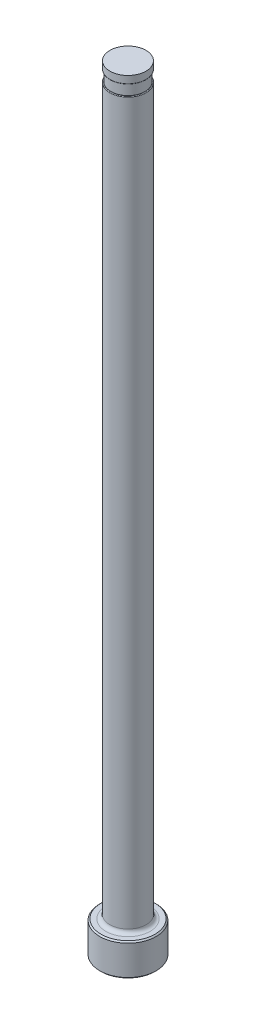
ISO-10303-21;
HEADER;
FILE_DESCRIPTION(('STEP AP214'),'2;1');
FILE_NAME('part.step','',(''),(''),'','','');
FILE_SCHEMA(('AUTOMOTIVE_DESIGN { 1 0 10303 214 1 1 1 1 }'));
ENDSEC;
DATA;
#1=APPLICATION_CONTEXT('core data for automotive mechanical design processes');
#2=APPLICATION_PROTOCOL_DEFINITION('international standard','automotive_design',2000,#1);
#3=PRODUCT_CONTEXT('',#1,'mechanical');
#4=PRODUCT('Part','Part','',(#3));
#5=PRODUCT_RELATED_PRODUCT_CATEGORY('part','',(#4));
#6=PRODUCT_DEFINITION_FORMATION('','',#4);
#7=PRODUCT_DEFINITION_CONTEXT('part definition',#1,'design');
#8=PRODUCT_DEFINITION('design','',#6,#7);
#9=PRODUCT_DEFINITION_SHAPE('','',#8);
#10=(LENGTH_UNIT() NAMED_UNIT(*) SI_UNIT(.MILLI.,.METRE.));
#11=(NAMED_UNIT(*) PLANE_ANGLE_UNIT() SI_UNIT($,.RADIAN.));
#12=(NAMED_UNIT(*) SI_UNIT($,.STERADIAN.) SOLID_ANGLE_UNIT());
#13=UNCERTAINTY_MEASURE_WITH_UNIT(LENGTH_MEASURE(1.E-05),#10,'distance_accuracy_value','');
#14=(GEOMETRIC_REPRESENTATION_CONTEXT(3) GLOBAL_UNCERTAINTY_ASSIGNED_CONTEXT((#13)) GLOBAL_UNIT_ASSIGNED_CONTEXT((#10,
#11,#12)) REPRESENTATION_CONTEXT('',''));
#15=CARTESIAN_POINT('',(0.,0.,0.));
#16=DIRECTION('',(0.,0.,1.));
#17=DIRECTION('',(1.,0.,0.));
#18=AXIS2_PLACEMENT_3D('',#15,#16,#17);
#19=CARTESIAN_POINT('',(-3.57123999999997,150.876,0.));
#20=DIRECTION('',(0.,1.,0.));
#21=DIRECTION('',(0.,0.,1.));
#22=AXIS2_PLACEMENT_3D('',#19,#20,#21);
#23=PLANE('',#22);
#24=CARTESIAN_POINT('',(0.,150.876,0.));
#25=DIRECTION('',(0.,1.,0.));
#26=DIRECTION('',(0.,0.,1.));
#27=AXIS2_PLACEMENT_3D('',#24,#25,#26);
#28=CIRCLE('',#27,3.41883999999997);
#29=CARTESIAN_POINT('',(0.,150.876,3.41883999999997));
#30=VERTEX_POINT('',#29);
#31=EDGE_CURVE('E11',#30,#30,#28,.F.);
#32=ORIENTED_EDGE('',*,*,#31,.T.);
#33=EDGE_LOOP('',(#32));
#34=FACE_BOUND('',#33,.T.);
#35=CARTESIAN_POINT('',(0.,150.876,0.));
#36=DIRECTION('',(0.,1.,0.));
#37=DIRECTION('',(0.,0.,1.));
#38=AXIS2_PLACEMENT_3D('',#35,#36,#37);
#39=CIRCLE('',#38,3.36803999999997);
#40=CARTESIAN_POINT('',(0.,150.876,3.36803999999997));
#41=VERTEX_POINT('',#40);
#42=EDGE_CURVE('E78',#41,#41,#39,.T.);
#43=ORIENTED_EDGE('',*,*,#42,.T.);
#44=EDGE_LOOP('',(#43));
#45=FACE_BOUND('',#44,.T.);
#46=ADVANCED_FACE('F36',(#34,#45),#23,.F.);
#47=CARTESIAN_POINT('',(0.,259.958771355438,0.));
#48=DIRECTION('',(0.,1.,0.));
#49=DIRECTION('',(0.,0.,1.));
#50=AXIS2_PLACEMENT_3D('',#47,#48,#49);
#51=CYLINDRICAL_SURFACE('',#50,3.57123999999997);
#52=DIRECTION('',(0.,1.,0.));
#53=VECTOR('',#52,1.);
#54=CARTESIAN_POINT('',(-3.36803999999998,259.958771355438,-1.18746018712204));
#55=LINE('',#54,#53);
#56=CARTESIAN_POINT('',(-3.36803999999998,148.717,-1.18746018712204));
#57=VERTEX_POINT('',#56);
#58=CARTESIAN_POINT('',(-3.36803999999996,86.36,-1.1874601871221));
#59=VERTEX_POINT('',#58);
#60=EDGE_CURVE('E73',#57,#59,#55,.F.);
#61=ORIENTED_EDGE('',*,*,#60,.F.);
#62=CARTESIAN_POINT('',(0.,148.717,0.));
#63=DIRECTION('',(0.,-1.,0.));
#64=DIRECTION('',(0.,0.,-1.));
#65=AXIS2_PLACEMENT_3D('',#62,#63,#64);
#66=CIRCLE('',#65,3.57123999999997);
#67=CARTESIAN_POINT('',(-3.36803999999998,148.717,1.18746018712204));
#68=VERTEX_POINT('',#67);
#69=EDGE_CURVE('E51',#57,#68,#66,.T.);
#70=ORIENTED_EDGE('',*,*,#69,.T.);
#71=DIRECTION('',(0.,1.,0.));
#72=VECTOR('',#71,1.);
#73=CARTESIAN_POINT('',(-3.36803999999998,259.958771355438,1.18746018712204));
#74=LINE('',#73,#72);
#75=CARTESIAN_POINT('',(-3.36803999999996,86.36,1.18746018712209));
#76=VERTEX_POINT('',#75);
#77=EDGE_CURVE('E84',#76,#68,#74,.T.);
#78=ORIENTED_EDGE('',*,*,#77,.F.);
#79=CARTESIAN_POINT('',(-3.36803999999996,86.36,-1.1874601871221));
#80=CARTESIAN_POINT('',(-3.3680377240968,86.3296283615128,-1.18745959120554));
#81=CARTESIAN_POINT('',(-3.36847634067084,86.29927189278,-1.18622334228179));
#82=CARTESIAN_POINT('',(-3.37021067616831,86.2387876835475,-1.18128966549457));
#83=CARTESIAN_POINT('',(-3.37150629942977,86.2086599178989,-1.1775925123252));
#84=CARTESIAN_POINT('',(-3.37663245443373,86.1190705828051,-1.16285138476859));
#85=CARTESIAN_POINT('',(-3.38170254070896,86.0602347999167,-1.14815759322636));
#86=CARTESIAN_POINT('',(-3.39461112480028,85.9460784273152,-1.10940606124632));
#87=CARTESIAN_POINT('',(-3.40245035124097,85.8907587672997,-1.08534585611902));
#88=CARTESIAN_POINT('',(-3.42005737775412,85.7851328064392,-1.02851526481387));
#89=CARTESIAN_POINT('',(-3.42982508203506,85.7348262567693,-0.995745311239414));
#90=CARTESIAN_POINT('',(-3.45028756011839,85.6403803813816,-0.922345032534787));
#91=CARTESIAN_POINT('',(-3.4609842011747,85.5962539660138,-0.881698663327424));
#92=CARTESIAN_POINT('',(-3.482209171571,85.5151926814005,-0.793737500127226));
#93=CARTESIAN_POINT('',(-3.49273745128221,85.4782598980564,-0.746420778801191));
#94=CARTESIAN_POINT('',(-3.51307583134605,85.4106585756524,-0.644120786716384));
#95=CARTESIAN_POINT('',(-3.52283072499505,85.3803557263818,-0.588885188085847));
#96=CARTESIAN_POINT('',(-3.54010786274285,85.3286078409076,-0.474091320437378));
#97=CARTESIAN_POINT('',(-3.54762954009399,85.3071650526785,-0.414531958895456));
#98=CARTESIAN_POINT('',(-3.56012114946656,85.2722555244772,-0.288969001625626));
#99=CARTESIAN_POINT('',(-3.56491124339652,85.2593434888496,-0.222793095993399));
#100=CARTESIAN_POINT('',(-3.57075657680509,85.243655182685,-0.0890807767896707));
#101=CARTESIAN_POINT('',(-3.57181063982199,85.240882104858,-0.0215439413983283));
#102=CARTESIAN_POINT('',(-3.57004535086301,85.2455778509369,0.115996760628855));
#103=CARTESIAN_POINT('',(-3.56706025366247,85.253484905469,0.185984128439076));
#104=CARTESIAN_POINT('',(-3.55722219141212,85.2803152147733,0.323545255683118));
#105=CARTESIAN_POINT('',(-3.55036911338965,85.2992387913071,0.391118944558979));
#106=CARTESIAN_POINT('',(-3.53356592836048,85.3478994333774,0.521506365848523));
#107=CARTESIAN_POINT('',(-3.52363012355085,85.3775866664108,0.584340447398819));
#108=CARTESIAN_POINT('',(-3.50178692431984,85.447455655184,0.703501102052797));
#109=CARTESIAN_POINT('',(-3.4898802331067,85.4876336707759,0.759829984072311));
#110=CARTESIAN_POINT('',(-3.46618365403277,85.5754388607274,0.861343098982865));
#111=CARTESIAN_POINT('',(-3.45441819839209,85.6225877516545,0.906946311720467));
#112=CARTESIAN_POINT('',(-3.4318469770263,85.7245334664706,0.98893672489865));
#113=CARTESIAN_POINT('',(-3.42104103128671,85.7793288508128,1.02532565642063));
#114=CARTESIAN_POINT('',(-3.40231953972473,85.8914535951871,1.08578170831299));
#115=CARTESIAN_POINT('',(-3.3942694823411,85.9484337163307,1.1104570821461));
#116=CARTESIAN_POINT('',(-3.38112795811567,86.0660270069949,1.14985485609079));
#117=CARTESIAN_POINT('',(-3.37603276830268,86.1266354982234,1.16458978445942));
#118=CARTESIAN_POINT('',(-3.37115526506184,86.2165050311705,1.17859463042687));
#119=CARTESIAN_POINT('',(-3.36998926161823,86.245115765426,1.18192009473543));
#120=CARTESIAN_POINT('',(-3.36843159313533,86.302479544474,1.18635035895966));
#121=CARTESIAN_POINT('',(-3.36803858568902,86.3312322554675,1.18745900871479));
#122=CARTESIAN_POINT('',(-3.36803999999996,86.36,1.1874601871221));
#123=B_SPLINE_CURVE_WITH_KNOTS('',3,(#79,#80,#81,#82,#83,#84,#85,#86,#87,#88,#89,#90,#91,#92,
#93,#94,#95,#96,#97,#98,#99,#100,#101,#102,#103,#104,#105,#106,#107,#108,#109,#110,#111,#112,
#113,#114,#115,#116,#117,#118,#119,#120,#121,#122),.UNSPECIFIED.,.F.,.F.,(4,2,2,2,2,2,2,2,2,2,2,
2,2,2,2,2,2,2,2,2,2,4),(0.,0.0910565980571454,0.182103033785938,0.363698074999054,
0.545340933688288,0.726974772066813,0.908982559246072,1.09104304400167,1.28146671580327,
1.47193867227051,1.67381993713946,1.87576476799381,2.08625256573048,2.29674651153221,
2.50627812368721,2.71573513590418,2.9146211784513,3.1134698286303,3.30038893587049,
3.48707202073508,3.57347157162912,3.65972094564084),.UNSPECIFIED.);
#124=EDGE_CURVE('E81',#59,#76,#123,.T.);
#125=ORIENTED_EDGE('',*,*,#124,.F.);
#126=EDGE_LOOP('',(#61,#70,#78,#125));
#127=FACE_BOUND('',#126,.T.);
#128=CARTESIAN_POINT('',(0.,7.11200000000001,0.));
#129=DIRECTION('',(0.,1.,0.));
#130=DIRECTION('',(0.,0.,1.));
#131=AXIS2_PLACEMENT_3D('',#128,#129,#130);
#132=CIRCLE('',#131,3.57123999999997);
#133=CARTESIAN_POINT('',(0.,7.11200000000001,3.57123999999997));
#134=VERTEX_POINT('',#133);
#135=EDGE_CURVE('E116',#134,#134,#132,.T.);
#136=ORIENTED_EDGE('',*,*,#135,.T.);
#137=EDGE_LOOP('',(#136));
#138=FACE_BOUND('',#137,.T.);
#139=ADVANCED_FACE('F82',(#127,#138),#51,.T.);
#140=CARTESIAN_POINT('',(0.,0.,0.));
#141=DIRECTION('',(0.,-1.,0.));
#142=DIRECTION('',(0.,0.,-1.));
#143=AXIS2_PLACEMENT_3D('',#140,#141,#142);
#144=PLANE('',#143);
#145=CARTESIAN_POINT('',(0.,0.,0.));
#146=DIRECTION('',(0.,-1.,0.));
#147=DIRECTION('',(0.,0.,-1.));
#148=AXIS2_PLACEMENT_3D('',#145,#146,#147);
#149=CIRCLE('',#148,5.29589999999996);
#150=CARTESIAN_POINT('',(0.,0.,-5.29589999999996));
#151=VERTEX_POINT('',#150);
#152=EDGE_CURVE('E113',#151,#151,#149,.T.);
#153=ORIENTED_EDGE('',*,*,#152,.T.);
#154=EDGE_LOOP('',(#153));
#155=FACE_BOUND('',#154,.T.);
#156=ADVANCED_FACE('F192',(#155),#144,.T.);
#157=CARTESIAN_POINT('',(0.,259.958771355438,0.));
#158=DIRECTION('',(0.,1.,0.));
#159=DIRECTION('',(0.,0.,1.));
#160=AXIS2_PLACEMENT_3D('',#157,#158,#159);
#161=CYLINDRICAL_SURFACE('',#160,5.54989999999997);
#162=CARTESIAN_POINT('',(0.,6.09599999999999,0.));
#163=DIRECTION('',(0.,1.,0.));
#164=DIRECTION('',(0.,0.,1.));
#165=AXIS2_PLACEMENT_3D('',#162,#163,#164);
#166=CIRCLE('',#165,5.54989999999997);
#167=CARTESIAN_POINT('',(0.,6.09599999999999,5.54989999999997));
#168=VERTEX_POINT('',#167);
#169=EDGE_CURVE('E110',#168,#168,#166,.F.);
#170=ORIENTED_EDGE('',*,*,#169,.T.);
#171=EDGE_LOOP('',(#170));
#172=FACE_BOUND('',#171,.T.);
#173=CARTESIAN_POINT('',(0.,0.253999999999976,0.));
#174=DIRECTION('',(0.,-1.,0.));
#175=DIRECTION('',(0.,0.,-1.));
#176=AXIS2_PLACEMENT_3D('',#173,#174,#175);
#177=CIRCLE('',#176,5.54989999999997);
#178=CARTESIAN_POINT('',(0.,0.253999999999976,-5.54989999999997));
#179=VERTEX_POINT('',#178);
#180=EDGE_CURVE('E107',#179,#179,#177,.F.);
#181=ORIENTED_EDGE('',*,*,#180,.T.);
#182=EDGE_LOOP('',(#181));
#183=FACE_BOUND('',#182,.T.);
#184=ADVANCED_FACE('F195',(#172,#183),#161,.T.);
#185=CARTESIAN_POINT('',(-5.54989999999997,6.35,0.));
#186=DIRECTION('',(0.,1.,0.));
#187=DIRECTION('',(0.,0.,1.));
#188=AXIS2_PLACEMENT_3D('',#185,#186,#187);
#189=PLANE('',#188);
#190=CARTESIAN_POINT('',(0.,6.35,0.));
#191=DIRECTION('',(0.,1.,0.));
#192=DIRECTION('',(0.,0.,1.));
#193=AXIS2_PLACEMENT_3D('',#190,#191,#192);
#194=CIRCLE('',#193,4.33323999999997);
#195=CARTESIAN_POINT('',(0.,6.35,4.33323999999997));
#196=VERTEX_POINT('',#195);
#197=EDGE_CURVE('E87',#196,#196,#194,.F.);
#198=ORIENTED_EDGE('',*,*,#197,.T.);
#199=EDGE_LOOP('',(#198));
#200=FACE_BOUND('',#199,.T.);
#201=CARTESIAN_POINT('',(0.,6.35,0.));
#202=DIRECTION('',(0.,1.,0.));
#203=DIRECTION('',(0.,0.,1.));
#204=AXIS2_PLACEMENT_3D('',#201,#202,#203);
#205=CIRCLE('',#204,5.29589999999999);
#206=CARTESIAN_POINT('',(0.,6.35,5.29589999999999));
#207=VERTEX_POINT('',#206);
#208=EDGE_CURVE('E104',#207,#207,#205,.T.);
#209=ORIENTED_EDGE('',*,*,#208,.T.);
#210=EDGE_LOOP('',(#209));
#211=FACE_BOUND('',#210,.T.);
#212=ADVANCED_FACE('F190',(#200,#211),#189,.T.);
#213=CARTESIAN_POINT('',(0.,6.35000000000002,0.));
#214=DIRECTION('',(0.,-1.,0.));
#215=DIRECTION('',(0.,0.,-1.));
#216=AXIS2_PLACEMENT_3D('',#213,#214,#215);
#217=CONICAL_SURFACE('',#216,5.29589999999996,0.785398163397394);
#218=ORIENTED_EDGE('',*,*,#169,.F.);
#219=EDGE_LOOP('',(#218));
#220=FACE_BOUND('',#219,.T.);
#221=ORIENTED_EDGE('',*,*,#208,.F.);
#222=EDGE_LOOP('',(#221));
#223=FACE_BOUND('',#222,.T.);
#224=ADVANCED_FACE('F186',(#220,#223),#217,.T.);
#225=CARTESIAN_POINT('',(0.,0.253999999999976,0.));
#226=DIRECTION('',(0.,1.,0.));
#227=DIRECTION('',(0.,0.,1.));
#228=AXIS2_PLACEMENT_3D('',#225,#226,#227);
#229=CONICAL_SURFACE('',#228,5.54989999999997,0.785398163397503);
#230=ORIENTED_EDGE('',*,*,#152,.F.);
#231=EDGE_LOOP('',(#230));
#232=FACE_BOUND('',#231,.T.);
#233=ORIENTED_EDGE('',*,*,#180,.F.);
#234=EDGE_LOOP('',(#233));
#235=FACE_BOUND('',#234,.T.);
#236=ADVANCED_FACE('F182',(#232,#235),#229,.T.);
#237=CARTESIAN_POINT('',(0.,7.11200000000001,0.));
#238=DIRECTION('',(0.,1.,0.));
#239=DIRECTION('',(0.,0.,1.));
#240=AXIS2_PLACEMENT_3D('',#237,#238,#239);
#241=TOROIDAL_SURFACE('',#240,4.33323999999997,0.762);
#242=ORIENTED_EDGE('',*,*,#197,.F.);
#243=EDGE_LOOP('',(#242));
#244=FACE_BOUND('',#243,.T.);
#245=ORIENTED_EDGE('',*,*,#135,.F.);
#246=EDGE_LOOP('',(#245));
#247=FACE_BOUND('',#246,.T.);
#248=ADVANCED_FACE('F147',(#244,#247),#241,.F.);
#249=CARTESIAN_POINT('',(-3.57123999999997,148.844,0.));
#250=DIRECTION('',(0.,-1.,0.));
#251=DIRECTION('',(0.,0.,-1.));
#252=AXIS2_PLACEMENT_3D('',#249,#250,#251);
#253=PLANE('',#252);
#254=DIRECTION('',(0.,0.,1.));
#255=VECTOR('',#254,1.);
#256=CARTESIAN_POINT('',(-3.36803999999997,148.844,0.));
#257=LINE('',#256,#255);
#258=CARTESIAN_POINT('',(-3.36803999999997,148.844,0.));
#259=VERTEX_POINT('',#258);
#260=CARTESIAN_POINT('',(-3.36803999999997,148.844,0.720482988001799));
#261=VERTEX_POINT('',#260);
#262=EDGE_CURVE('E90',#259,#261,#257,.T.);
#263=ORIENTED_EDGE('',*,*,#262,.T.);
#264=CARTESIAN_POINT('',(0.,148.844,0.));
#265=DIRECTION('',(0.,-1.,0.));
#266=DIRECTION('',(0.,0.,-1.));
#267=AXIS2_PLACEMENT_3D('',#264,#265,#266);
#268=CIRCLE('',#267,3.44423999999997);
#269=CARTESIAN_POINT('',(-3.36803999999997,148.844,-0.720482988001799));
#270=VERTEX_POINT('',#269);
#271=EDGE_CURVE('E86',#261,#270,#268,.F.);
#272=ORIENTED_EDGE('',*,*,#271,.T.);
#273=EDGE_CURVE('E79',#270,#259,#257,.T.);
#274=ORIENTED_EDGE('',*,*,#273,.T.);
#275=CARTESIAN_POINT('',(0.,148.844,0.));
#276=DIRECTION('',(0.,1.,0.));
#277=DIRECTION('',(0.,0.,1.));
#278=AXIS2_PLACEMENT_3D('',#275,#276,#277);
#279=CIRCLE('',#278,3.36803999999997);
#280=EDGE_CURVE('E101',#259,#259,#279,.T.);
#281=ORIENTED_EDGE('',*,*,#280,.F.);
#282=EDGE_LOOP('',(#263,#272,#274,#281));
#283=FACE_BOUND('',#282,.T.);
#284=ADVANCED_FACE('F144',(#283),#253,.F.);
#285=CARTESIAN_POINT('',(0.,153.448281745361,0.));
#286=DIRECTION('',(0.,1.,0.));
#287=DIRECTION('',(0.,0.,1.));
#288=AXIS2_PLACEMENT_3D('',#285,#286,#287);
#289=CYLINDRICAL_SURFACE('',#288,3.36803999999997);
#290=ORIENTED_EDGE('',*,*,#42,.F.);
#291=EDGE_LOOP('',(#290));
#292=FACE_BOUND('',#291,.T.);
#293=ORIENTED_EDGE('',*,*,#280,.T.);
#294=EDGE_LOOP('',(#293));
#295=FACE_BOUND('',#294,.T.);
#296=ADVANCED_FACE('F141',(#292,#295),#289,.T.);
#297=CARTESIAN_POINT('',(-3.36803999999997,149.86,-5.54989999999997));
#298=DIRECTION('',(1.,0.,0.));
#299=DIRECTION('',(0.,1.,0.));
#300=AXIS2_PLACEMENT_3D('',#297,#298,#299);
#301=PLANE('',#300);
#302=ORIENTED_EDGE('',*,*,#273,.F.);
#303=CARTESIAN_POINT('',(-3.36803999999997,148.844,-0.720482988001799));
#304=CARTESIAN_POINT('',(-3.36803999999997,148.843993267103,-0.741667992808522));
#305=CARTESIAN_POINT('',(-3.36803999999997,148.843767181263,-0.762857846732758));
#306=CARTESIAN_POINT('',(-3.36803999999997,148.84271621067,-0.805256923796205));
#307=CARTESIAN_POINT('',(-3.36803999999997,148.841890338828,-0.826466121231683));
#308=CARTESIAN_POINT('',(-3.36803999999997,148.839476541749,-0.868880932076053));
#309=CARTESIAN_POINT('',(-3.36803999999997,148.837887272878,-0.890086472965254));
#310=CARTESIAN_POINT('',(-3.36803999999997,148.833714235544,-0.93239051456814));
#311=CARTESIAN_POINT('',(-3.36803999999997,148.831131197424,-0.953489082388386));
#312=CARTESIAN_POINT('',(-3.36803999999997,148.825919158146,-0.987044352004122));
#313=CARTESIAN_POINT('',(-3.36803999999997,148.823725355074,-0.999568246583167));
#314=CARTESIAN_POINT('',(-3.36803999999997,148.818729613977,-1.02450849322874));
#315=CARTESIAN_POINT('',(-3.36803999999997,148.81592716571,-1.03692474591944));
#316=CARTESIAN_POINT('',(-3.36803999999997,148.809430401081,-1.06198397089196));
#317=CARTESIAN_POINT('',(-3.36803999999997,148.805708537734,-1.07461988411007));
#318=CARTESIAN_POINT('',(-3.36803999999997,148.797125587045,-1.09949809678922));
#319=CARTESIAN_POINT('',(-3.36803999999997,148.792266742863,-1.1117411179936));
#320=CARTESIAN_POINT('',(-3.36803999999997,148.783811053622,-1.12921604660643));
#321=CARTESIAN_POINT('',(-3.36803999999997,148.78088164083,-1.13476833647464));
#322=CARTESIAN_POINT('',(-3.36803999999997,148.774508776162,-1.14558508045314));
#323=CARTESIAN_POINT('',(-3.36803999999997,148.771064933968,-1.15084931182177));
#324=CARTESIAN_POINT('',(-3.36803999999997,148.764291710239,-1.15984658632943));
#325=CARTESIAN_POINT('',(-3.36803999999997,148.761085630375,-1.1636712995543));
#326=CARTESIAN_POINT('',(-3.36803999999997,148.754150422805,-1.17081956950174));
#327=CARTESIAN_POINT('',(-3.36803999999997,148.750422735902,-1.1741444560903));
#328=CARTESIAN_POINT('',(-3.36803999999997,148.744066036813,-1.17872666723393));
#329=CARTESIAN_POINT('',(-3.36803999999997,148.741640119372,-1.1802633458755));
#330=CARTESIAN_POINT('',(-3.36803999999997,148.736593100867,-1.18295888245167));
#331=CARTESIAN_POINT('',(-3.36803999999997,148.733972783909,-1.18411916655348));
#332=CARTESIAN_POINT('',(-3.36803999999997,148.728986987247,-1.18581641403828));
#333=CARTESIAN_POINT('',(-3.36803999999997,148.726645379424,-1.18642231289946));
#334=CARTESIAN_POINT('',(-3.36803999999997,148.721871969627,-1.18724906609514));
#335=CARTESIAN_POINT('',(-3.36803999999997,148.719439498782,-1.18746599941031));
#336=CARTESIAN_POINT('',(-3.36803999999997,148.717,-1.18746018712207));
#337=B_SPLINE_CURVE_WITH_KNOTS('',3,(#303,#304,#305,#306,#307,#308,#309,#310,#311,#312,#313,
#314,#315,#316,#317,#318,#319,#320,#321,#322,#323,#324,#325,#326,#327,#328,#329,#330,#331,#332,
#333,#334,#335,#336),.UNSPECIFIED.,.F.,.F.,(4,2,2,2,2,2,2,2,2,2,2,2,2,2,2,2,4),(0.,
0.0635614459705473,0.127227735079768,0.191006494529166,0.254738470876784,0.292871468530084,
0.331036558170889,0.370524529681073,0.409935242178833,0.428750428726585,0.447579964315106,
0.462519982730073,0.477419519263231,0.486010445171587,0.494568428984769,0.501793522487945,
0.509091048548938),.UNSPECIFIED.);
#338=EDGE_CURVE('E59',#270,#57,#337,.T.);
#339=ORIENTED_EDGE('',*,*,#338,.T.);
#340=ORIENTED_EDGE('',*,*,#60,.T.);
#341=DIRECTION('',(0.,0.,1.));
#342=VECTOR('',#341,1.);
#343=CARTESIAN_POINT('',(-3.36803999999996,86.36,-5.54989999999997));
#344=LINE('',#343,#342);
#345=EDGE_CURVE('E77',#59,#76,#344,.T.);
#346=ORIENTED_EDGE('',*,*,#345,.T.);
#347=ORIENTED_EDGE('',*,*,#77,.T.);
#348=CARTESIAN_POINT('',(-3.36803999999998,148.717,1.18746018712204));
#349=CARTESIAN_POINT('',(-3.36803999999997,148.719718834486,1.18746847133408));
#350=CARTESIAN_POINT('',(-3.36803999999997,148.722426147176,1.18719803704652));
#351=CARTESIAN_POINT('',(-3.36803999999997,148.727714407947,1.18617805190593));
#352=CARTESIAN_POINT('',(-3.36803999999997,148.730296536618,1.18543473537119));
#353=CARTESIAN_POINT('',(-3.36803999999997,148.735910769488,1.18331500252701));
#354=CARTESIAN_POINT('',(-3.36803999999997,148.738900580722,1.18182891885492));
#355=CARTESIAN_POINT('',(-3.36803999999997,148.744613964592,1.17839592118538));
#356=CARTESIAN_POINT('',(-3.36803999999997,148.74733604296,1.17644660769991));
#357=CARTESIAN_POINT('',(-3.36803999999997,148.75427895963,1.17078841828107));
#358=CARTESIAN_POINT('',(-3.36803999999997,148.758257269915,1.16678561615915));
#359=CARTESIAN_POINT('',(-3.36803999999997,148.765603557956,1.15826505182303));
#360=CARTESIAN_POINT('',(-3.36803999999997,148.76897020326,1.15374619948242));
#361=CARTESIAN_POINT('',(-3.36803999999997,148.780637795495,1.13637607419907));
#362=CARTESIAN_POINT('',(-3.36803999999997,148.78746833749,1.1225589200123));
#363=CARTESIAN_POINT('',(-3.36803999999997,148.799284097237,1.09405878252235));
#364=CARTESIAN_POINT('',(-3.36803999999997,148.804244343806,1.07936692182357));
#365=CARTESIAN_POINT('',(-3.36803999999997,148.81278105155,1.04990009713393));
#366=CARTESIAN_POINT('',(-3.36803999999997,148.816383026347,1.03513257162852));
#367=CARTESIAN_POINT('',(-3.36803999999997,148.822680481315,1.00540216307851));
#368=CARTESIAN_POINT('',(-3.36803999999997,148.825375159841,0.990439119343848));
#369=CARTESIAN_POINT('',(-3.36803999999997,148.832439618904,0.945273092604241));
#370=CARTESIAN_POINT('',(-3.36803999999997,148.835761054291,0.914907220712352));
#371=CARTESIAN_POINT('',(-3.36803999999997,148.840361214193,0.857080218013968));
#372=CARTESIAN_POINT('',(-3.36803999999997,148.8418100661,0.829630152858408));
#373=CARTESIAN_POINT('',(-3.36803999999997,148.843615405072,0.77494452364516));
#374=CARTESIAN_POINT('',(-3.36803999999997,148.843981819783,0.747709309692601));
#375=CARTESIAN_POINT('',(-3.36803999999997,148.844,0.720482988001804));
#376=B_SPLINE_CURVE_WITH_KNOTS('',3,(#348,#349,#350,#351,#352,#353,#354,#355,#356,#357,#358,
#359,#360,#361,#362,#363,#364,#365,#366,#367,#368,#369,#370,#371,#372,#373,#374,#375),
.UNSPECIFIED.,.F.,.F.,(4,2,2,2,2,2,2,2,2,2,2,2,2,4),(0.,0.00812455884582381,0.0161441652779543,
0.0261041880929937,0.0361169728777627,0.0529520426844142,0.0698233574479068,0.115707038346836,
0.162183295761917,0.20773700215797,0.253330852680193,0.34486973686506,0.42731634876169,
0.509004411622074),.UNSPECIFIED.);
#377=EDGE_CURVE('E172',#68,#261,#376,.T.);
#378=ORIENTED_EDGE('',*,*,#377,.T.);
#379=ORIENTED_EDGE('',*,*,#262,.F.);
#380=EDGE_LOOP('',(#302,#339,#340,#346,#347,#378,#379));
#381=FACE_BOUND('',#380,.T.);
#382=ADVANCED_FACE('F75',(#381),#301,.F.);
#383=CARTESIAN_POINT('',(-6.54303999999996,86.36,-5.54989999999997));
#384=DIRECTION('',(0.,0.,1.));
#385=DIRECTION('',(1.,0.,0.));
#386=AXIS2_PLACEMENT_3D('',#383,#384,#385);
#387=CYLINDRICAL_SURFACE('',#386,3.175);
#388=ORIENTED_EDGE('',*,*,#345,.F.);
#389=ORIENTED_EDGE('',*,*,#124,.T.);
#390=EDGE_LOOP('',(#388,#389));
#391=FACE_BOUND('',#390,.T.);
#392=ADVANCED_FACE('F89',(#391),#387,.F.);
#393=CARTESIAN_POINT('',(0.,152.687735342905,0.));
#394=DIRECTION('',(0.,1.,0.));
#395=DIRECTION('',(0.,0.,1.));
#396=AXIS2_PLACEMENT_3D('',#393,#394,#395);
#397=CYLINDRICAL_SURFACE('',#396,3.54583999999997);
#398=CARTESIAN_POINT('',(0.,151.003,0.));
#399=DIRECTION('',(0.,1.,0.));
#400=DIRECTION('',(0.,0.,1.));
#401=AXIS2_PLACEMENT_3D('',#398,#399,#400);
#402=CIRCLE('',#401,3.54583999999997);
#403=CARTESIAN_POINT('',(0.,151.003,3.54583999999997));
#404=VERTEX_POINT('',#403);
#405=EDGE_CURVE('E44',#404,#404,#402,.T.);
#406=ORIENTED_EDGE('',*,*,#405,.T.);
#407=EDGE_LOOP('',(#406));
#408=FACE_BOUND('',#407,.T.);
#409=CARTESIAN_POINT('',(0.,152.4,0.));
#410=DIRECTION('',(0.,1.,0.));
#411=DIRECTION('',(0.,0.,1.));
#412=AXIS2_PLACEMENT_3D('',#409,#410,#411);
#413=CIRCLE('',#412,3.54583999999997);
#414=CARTESIAN_POINT('',(0.,152.4,3.54583999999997));
#415=VERTEX_POINT('',#414);
#416=EDGE_CURVE('E91',#415,#415,#413,.T.);
#417=ORIENTED_EDGE('',*,*,#416,.F.);
#418=EDGE_LOOP('',(#417));
#419=FACE_BOUND('',#418,.T.);
#420=ADVANCED_FACE('F135',(#408,#419),#397,.T.);
#421=CARTESIAN_POINT('',(-3.57123999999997,152.4,0.));
#422=DIRECTION('',(0.,1.,0.));
#423=DIRECTION('',(0.,0.,1.));
#424=AXIS2_PLACEMENT_3D('',#421,#422,#423);
#425=PLANE('',#424);
#426=ORIENTED_EDGE('',*,*,#416,.T.);
#427=EDGE_LOOP('',(#426));
#428=FACE_BOUND('',#427,.T.);
#429=ADVANCED_FACE('F149',(#428),#425,.T.);
#430=CARTESIAN_POINT('',(0.,148.717,0.));
#431=DIRECTION('',(0.,-1.,0.));
#432=DIRECTION('',(0.,0.,-1.));
#433=AXIS2_PLACEMENT_3D('',#430,#431,#432);
#434=TOROIDAL_SURFACE('',#433,3.44423999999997,0.127);
#435=ORIENTED_EDGE('',*,*,#377,.F.);
#436=ORIENTED_EDGE('',*,*,#69,.F.);
#437=ORIENTED_EDGE('',*,*,#338,.F.);
#438=ORIENTED_EDGE('',*,*,#271,.F.);
#439=EDGE_LOOP('',(#435,#436,#437,#438));
#440=FACE_BOUND('',#439,.T.);
#441=ADVANCED_FACE('F151',(#440),#434,.T.);
#442=CARTESIAN_POINT('',(0.,151.003,0.));
#443=DIRECTION('',(0.,1.,0.));
#444=DIRECTION('',(0.,0.,1.));
#445=AXIS2_PLACEMENT_3D('',#442,#443,#444);
#446=TOROIDAL_SURFACE('',#445,3.41883999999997,0.127);
#447=ORIENTED_EDGE('',*,*,#31,.F.);
#448=EDGE_LOOP('',(#447));
#449=FACE_BOUND('',#448,.T.);
#450=ORIENTED_EDGE('',*,*,#405,.F.);
#451=EDGE_LOOP('',(#450));
#452=FACE_BOUND('',#451,.T.);
#453=ADVANCED_FACE('F38',(#449,#452),#446,.T.);
#454=CLOSED_SHELL('',(#46,#139,#156,#184,#212,#224,#236,#248,#284,#296,#382,#392,#420,#429,#441,#453));
#455=MANIFOLD_SOLID_BREP('B2',#454);
#456=ADVANCED_BREP_SHAPE_REPRESENTATION('',(#18,#455),#14);
#457=SHAPE_DEFINITION_REPRESENTATION(#9,#456);
ENDSEC;
END-ISO-10303-21;
